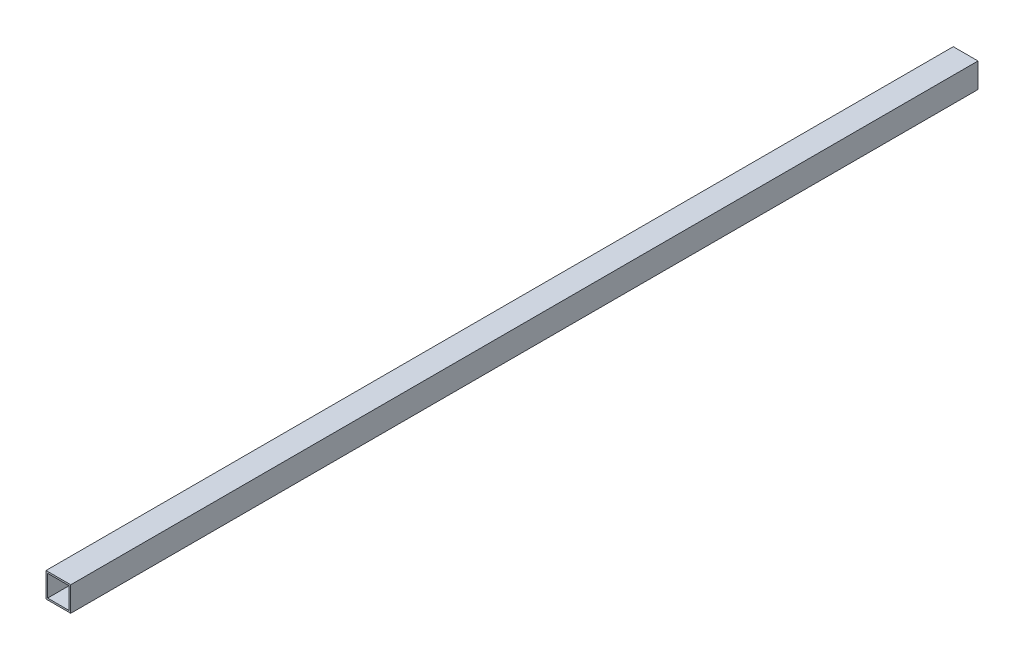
ISO-10303-21;
HEADER;
FILE_DESCRIPTION(('STEP AP214'),'2;1');
FILE_NAME('part.step','',(''),(''),'','','');
FILE_SCHEMA(('AUTOMOTIVE_DESIGN { 1 0 10303 214 1 1 1 1 }'));
ENDSEC;
DATA;
#1=APPLICATION_CONTEXT('core data for automotive mechanical design processes');
#2=APPLICATION_PROTOCOL_DEFINITION('international standard','automotive_design',2000,#1);
#3=PRODUCT_CONTEXT('',#1,'mechanical');
#4=PRODUCT('Part','Part','',(#3));
#5=PRODUCT_RELATED_PRODUCT_CATEGORY('part','',(#4));
#6=PRODUCT_DEFINITION_FORMATION('','',#4);
#7=PRODUCT_DEFINITION_CONTEXT('part definition',#1,'design');
#8=PRODUCT_DEFINITION('design','',#6,#7);
#9=PRODUCT_DEFINITION_SHAPE('','',#8);
#10=(LENGTH_UNIT() NAMED_UNIT(*) SI_UNIT(.MILLI.,.METRE.));
#11=(NAMED_UNIT(*) PLANE_ANGLE_UNIT() SI_UNIT($,.RADIAN.));
#12=(NAMED_UNIT(*) SI_UNIT($,.STERADIAN.) SOLID_ANGLE_UNIT());
#13=UNCERTAINTY_MEASURE_WITH_UNIT(LENGTH_MEASURE(1.E-05),#10,'distance_accuracy_value','');
#14=(GEOMETRIC_REPRESENTATION_CONTEXT(3) GLOBAL_UNCERTAINTY_ASSIGNED_CONTEXT((#13)) GLOBAL_UNIT_ASSIGNED_CONTEXT((#10,
#11,#12)) REPRESENTATION_CONTEXT('',''));
#15=CARTESIAN_POINT('',(0.,0.,0.));
#16=DIRECTION('',(0.,0.,1.));
#17=DIRECTION('',(1.,0.,0.));
#18=AXIS2_PLACEMENT_3D('',#15,#16,#17);
#19=CARTESIAN_POINT('',(-15.,-15.,1100.));
#20=DIRECTION('',(0.,0.,1.));
#21=DIRECTION('',(1.,0.,0.));
#22=AXIS2_PLACEMENT_3D('',#19,#20,#21);
#23=PLANE('',#22);
#24=DIRECTION('',(0.,-1.,0.));
#25=VECTOR('',#24,1.);
#26=CARTESIAN_POINT('',(-15.,15.,1100.));
#27=LINE('',#26,#25);
#28=CARTESIAN_POINT('',(-15.,15.,1100.));
#29=VERTEX_POINT('',#28);
#30=CARTESIAN_POINT('',(-15.,-15.,1100.));
#31=VERTEX_POINT('',#30);
#32=EDGE_CURVE('E155',#29,#31,#27,.T.);
#33=ORIENTED_EDGE('',*,*,#32,.T.);
#34=DIRECTION('',(1.,0.,0.));
#35=VECTOR('',#34,1.);
#36=CARTESIAN_POINT('',(-15.,-15.,1100.));
#37=LINE('',#36,#35);
#38=CARTESIAN_POINT('',(15.,-15.,1100.));
#39=VERTEX_POINT('',#38);
#40=EDGE_CURVE('E158',#31,#39,#37,.T.);
#41=ORIENTED_EDGE('',*,*,#40,.T.);
#42=DIRECTION('',(0.,1.,0.));
#43=VECTOR('',#42,1.);
#44=CARTESIAN_POINT('',(15.,15.,1100.));
#45=LINE('',#44,#43);
#46=CARTESIAN_POINT('',(15.,15.,1100.));
#47=VERTEX_POINT('',#46);
#48=EDGE_CURVE('E161',#39,#47,#45,.T.);
#49=ORIENTED_EDGE('',*,*,#48,.T.);
#50=DIRECTION('',(-1.,0.,0.));
#51=VECTOR('',#50,1.);
#52=CARTESIAN_POINT('',(-15.,15.,1100.));
#53=LINE('',#52,#51);
#54=EDGE_CURVE('E163',#47,#29,#53,.T.);
#55=ORIENTED_EDGE('',*,*,#54,.T.);
#56=EDGE_LOOP('',(#33,#41,#49,#55));
#57=FACE_BOUND('',#56,.T.);
#58=DIRECTION('',(1.,0.,0.));
#59=VECTOR('',#58,1.);
#60=CARTESIAN_POINT('',(-15.,-13.,1100.));
#61=LINE('',#60,#59);
#62=CARTESIAN_POINT('',(-13.,-13.,1100.));
#63=VERTEX_POINT('',#62);
#64=CARTESIAN_POINT('',(13.,-13.,1100.));
#65=VERTEX_POINT('',#64);
#66=EDGE_CURVE('E127',#63,#65,#61,.T.);
#67=ORIENTED_EDGE('',*,*,#66,.F.);
#68=DIRECTION('',(0.,-1.,0.));
#69=VECTOR('',#68,1.);
#70=CARTESIAN_POINT('',(-13.,15.,1100.));
#71=LINE('',#70,#69);
#72=CARTESIAN_POINT('',(-13.,13.,1100.));
#73=VERTEX_POINT('',#72);
#74=EDGE_CURVE('E119',#73,#63,#71,.T.);
#75=ORIENTED_EDGE('',*,*,#74,.F.);
#76=DIRECTION('',(-1.,0.,0.));
#77=VECTOR('',#76,1.);
#78=CARTESIAN_POINT('',(-15.,13.,1100.));
#79=LINE('',#78,#77);
#80=CARTESIAN_POINT('',(13.,13.,1100.));
#81=VERTEX_POINT('',#80);
#82=EDGE_CURVE('E141',#81,#73,#79,.T.);
#83=ORIENTED_EDGE('',*,*,#82,.F.);
#84=DIRECTION('',(0.,1.,0.));
#85=VECTOR('',#84,1.);
#86=CARTESIAN_POINT('',(13.,15.,1100.));
#87=LINE('',#86,#85);
#88=EDGE_CURVE('E139',#65,#81,#87,.T.);
#89=ORIENTED_EDGE('',*,*,#88,.F.);
#90=EDGE_LOOP('',(#67,#75,#83,#89));
#91=FACE_BOUND('',#90,.T.);
#92=ADVANCED_FACE('F54',(#57,#91),#23,.T.);
#93=CARTESIAN_POINT('',(-15.,-15.,0.));
#94=DIRECTION('',(0.,0.,1.));
#95=DIRECTION('',(1.,0.,0.));
#96=AXIS2_PLACEMENT_3D('',#93,#94,#95);
#97=PLANE('',#96);
#98=DIRECTION('',(0.,-1.,0.));
#99=VECTOR('',#98,1.);
#100=CARTESIAN_POINT('',(-15.,15.,0.));
#101=LINE('',#100,#99);
#102=CARTESIAN_POINT('',(-15.,15.,0.));
#103=VERTEX_POINT('',#102);
#104=CARTESIAN_POINT('',(-15.,-15.,0.));
#105=VERTEX_POINT('',#104);
#106=EDGE_CURVE('E135',#103,#105,#101,.T.);
#107=ORIENTED_EDGE('',*,*,#106,.F.);
#108=DIRECTION('',(-1.,0.,0.));
#109=VECTOR('',#108,1.);
#110=CARTESIAN_POINT('',(-15.,15.,0.));
#111=LINE('',#110,#109);
#112=CARTESIAN_POINT('',(15.,15.,0.));
#113=VERTEX_POINT('',#112);
#114=EDGE_CURVE('E159',#113,#103,#111,.T.);
#115=ORIENTED_EDGE('',*,*,#114,.F.);
#116=DIRECTION('',(0.,1.,0.));
#117=VECTOR('',#116,1.);
#118=CARTESIAN_POINT('',(15.,15.,0.));
#119=LINE('',#118,#117);
#120=CARTESIAN_POINT('',(15.,-15.,0.));
#121=VERTEX_POINT('',#120);
#122=EDGE_CURVE('E170',#121,#113,#119,.T.);
#123=ORIENTED_EDGE('',*,*,#122,.F.);
#124=DIRECTION('',(1.,0.,0.));
#125=VECTOR('',#124,1.);
#126=CARTESIAN_POINT('',(-15.,-15.,0.));
#127=LINE('',#126,#125);
#128=EDGE_CURVE('E168',#105,#121,#127,.T.);
#129=ORIENTED_EDGE('',*,*,#128,.F.);
#130=EDGE_LOOP('',(#107,#115,#123,#129));
#131=FACE_BOUND('',#130,.T.);
#132=DIRECTION('',(0.,-1.,0.));
#133=VECTOR('',#132,1.);
#134=CARTESIAN_POINT('',(-13.,15.,0.));
#135=LINE('',#134,#133);
#136=CARTESIAN_POINT('',(-13.,13.,0.));
#137=VERTEX_POINT('',#136);
#138=CARTESIAN_POINT('',(-13.,-13.,0.));
#139=VERTEX_POINT('',#138);
#140=EDGE_CURVE('E77',#137,#139,#135,.T.);
#141=ORIENTED_EDGE('',*,*,#140,.T.);
#142=DIRECTION('',(1.,0.,0.));
#143=VECTOR('',#142,1.);
#144=CARTESIAN_POINT('',(-15.,-13.,0.));
#145=LINE('',#144,#143);
#146=CARTESIAN_POINT('',(13.,-13.,0.));
#147=VERTEX_POINT('',#146);
#148=EDGE_CURVE('E134',#139,#147,#145,.T.);
#149=ORIENTED_EDGE('',*,*,#148,.T.);
#150=DIRECTION('',(0.,1.,0.));
#151=VECTOR('',#150,1.);
#152=CARTESIAN_POINT('',(13.,15.,0.));
#153=LINE('',#152,#151);
#154=CARTESIAN_POINT('',(13.,13.,0.));
#155=VERTEX_POINT('',#154);
#156=EDGE_CURVE('E147',#147,#155,#153,.T.);
#157=ORIENTED_EDGE('',*,*,#156,.T.);
#158=DIRECTION('',(-1.,0.,0.));
#159=VECTOR('',#158,1.);
#160=CARTESIAN_POINT('',(-15.,13.,0.));
#161=LINE('',#160,#159);
#162=EDGE_CURVE('E128',#155,#137,#161,.T.);
#163=ORIENTED_EDGE('',*,*,#162,.T.);
#164=EDGE_LOOP('',(#141,#149,#157,#163));
#165=FACE_BOUND('',#164,.T.);
#166=ADVANCED_FACE('F188',(#131,#165),#97,.F.);
#167=CARTESIAN_POINT('',(-15.,15.,1100.));
#168=DIRECTION('',(1.,0.,0.));
#169=DIRECTION('',(0.,1.,0.));
#170=AXIS2_PLACEMENT_3D('',#167,#168,#169);
#171=PLANE('',#170);
#172=ORIENTED_EDGE('',*,*,#106,.T.);
#173=DIRECTION('',(0.,0.,-1.));
#174=VECTOR('',#173,1.);
#175=CARTESIAN_POINT('',(-15.,-15.,1100.));
#176=LINE('',#175,#174);
#177=EDGE_CURVE('E12',#31,#105,#176,.T.);
#178=ORIENTED_EDGE('',*,*,#177,.F.);
#179=ORIENTED_EDGE('',*,*,#32,.F.);
#180=DIRECTION('',(0.,0.,-1.));
#181=VECTOR('',#180,1.);
#182=CARTESIAN_POINT('',(-15.,15.,1100.));
#183=LINE('',#182,#181);
#184=EDGE_CURVE('E165',#29,#103,#183,.T.);
#185=ORIENTED_EDGE('',*,*,#184,.T.);
#186=EDGE_LOOP('',(#172,#178,#179,#185));
#187=FACE_BOUND('',#186,.T.);
#188=ADVANCED_FACE('F56',(#187),#171,.F.);
#189=CARTESIAN_POINT('',(-15.,-15.,1100.));
#190=DIRECTION('',(0.,1.,0.));
#191=DIRECTION('',(-1.,0.,0.));
#192=AXIS2_PLACEMENT_3D('',#189,#190,#191);
#193=PLANE('',#192);
#194=ORIENTED_EDGE('',*,*,#128,.T.);
#195=DIRECTION('',(0.,0.,-1.));
#196=VECTOR('',#195,1.);
#197=CARTESIAN_POINT('',(15.,-15.,1100.));
#198=LINE('',#197,#196);
#199=EDGE_CURVE('E62',#39,#121,#198,.T.);
#200=ORIENTED_EDGE('',*,*,#199,.F.);
#201=ORIENTED_EDGE('',*,*,#40,.F.);
#202=ORIENTED_EDGE('',*,*,#177,.T.);
#203=EDGE_LOOP('',(#194,#200,#201,#202));
#204=FACE_BOUND('',#203,.T.);
#205=ADVANCED_FACE('F198',(#204),#193,.F.);
#206=CARTESIAN_POINT('',(15.,15.,1100.));
#207=DIRECTION('',(-1.,0.,0.));
#208=DIRECTION('',(0.,0.,1.));
#209=AXIS2_PLACEMENT_3D('',#206,#207,#208);
#210=PLANE('',#209);
#211=ORIENTED_EDGE('',*,*,#122,.T.);
#212=DIRECTION('',(0.,0.,-1.));
#213=VECTOR('',#212,1.);
#214=CARTESIAN_POINT('',(15.,15.,1100.));
#215=LINE('',#214,#213);
#216=EDGE_CURVE('E175',#47,#113,#215,.T.);
#217=ORIENTED_EDGE('',*,*,#216,.F.);
#218=ORIENTED_EDGE('',*,*,#48,.F.);
#219=ORIENTED_EDGE('',*,*,#199,.T.);
#220=EDGE_LOOP('',(#211,#217,#218,#219));
#221=FACE_BOUND('',#220,.T.);
#222=ADVANCED_FACE('F182',(#221),#210,.F.);
#223=CARTESIAN_POINT('',(-15.,15.,1100.));
#224=DIRECTION('',(0.,-1.,0.));
#225=DIRECTION('',(1.,0.,0.));
#226=AXIS2_PLACEMENT_3D('',#223,#224,#225);
#227=PLANE('',#226);
#228=ORIENTED_EDGE('',*,*,#114,.T.);
#229=ORIENTED_EDGE('',*,*,#184,.F.);
#230=ORIENTED_EDGE('',*,*,#54,.F.);
#231=ORIENTED_EDGE('',*,*,#216,.T.);
#232=EDGE_LOOP('',(#228,#229,#230,#231));
#233=FACE_BOUND('',#232,.T.);
#234=ADVANCED_FACE('F192',(#233),#227,.F.);
#235=CARTESIAN_POINT('',(-13.,15.,1100.));
#236=DIRECTION('',(1.,0.,0.));
#237=DIRECTION('',(0.,1.,0.));
#238=AXIS2_PLACEMENT_3D('',#235,#236,#237);
#239=PLANE('',#238);
#240=ORIENTED_EDGE('',*,*,#140,.F.);
#241=DIRECTION('',(0.,0.,-1.));
#242=VECTOR('',#241,1.);
#243=CARTESIAN_POINT('',(-13.,13.,1100.));
#244=LINE('',#243,#242);
#245=EDGE_CURVE('E123',#73,#137,#244,.T.);
#246=ORIENTED_EDGE('',*,*,#245,.F.);
#247=ORIENTED_EDGE('',*,*,#74,.T.);
#248=DIRECTION('',(0.,0.,-1.));
#249=VECTOR('',#248,1.);
#250=CARTESIAN_POINT('',(-13.,-13.,1100.));
#251=LINE('',#250,#249);
#252=EDGE_CURVE('E122',#63,#139,#251,.T.);
#253=ORIENTED_EDGE('',*,*,#252,.T.);
#254=EDGE_LOOP('',(#240,#246,#247,#253));
#255=FACE_BOUND('',#254,.T.);
#256=ADVANCED_FACE('F121',(#255),#239,.T.);
#257=CARTESIAN_POINT('',(-15.,-13.,1100.));
#258=DIRECTION('',(0.,1.,0.));
#259=DIRECTION('',(-1.,0.,0.));
#260=AXIS2_PLACEMENT_3D('',#257,#258,#259);
#261=PLANE('',#260);
#262=ORIENTED_EDGE('',*,*,#148,.F.);
#263=ORIENTED_EDGE('',*,*,#252,.F.);
#264=ORIENTED_EDGE('',*,*,#66,.T.);
#265=DIRECTION('',(0.,0.,-1.));
#266=VECTOR('',#265,1.);
#267=CARTESIAN_POINT('',(13.,-13.,1100.));
#268=LINE('',#267,#266);
#269=EDGE_CURVE('E136',#65,#147,#268,.T.);
#270=ORIENTED_EDGE('',*,*,#269,.T.);
#271=EDGE_LOOP('',(#262,#263,#264,#270));
#272=FACE_BOUND('',#271,.T.);
#273=ADVANCED_FACE('F131',(#272),#261,.T.);
#274=CARTESIAN_POINT('',(13.,15.,1100.));
#275=DIRECTION('',(-1.,0.,0.));
#276=DIRECTION('',(0.,0.,1.));
#277=AXIS2_PLACEMENT_3D('',#274,#275,#276);
#278=PLANE('',#277);
#279=ORIENTED_EDGE('',*,*,#156,.F.);
#280=ORIENTED_EDGE('',*,*,#269,.F.);
#281=ORIENTED_EDGE('',*,*,#88,.T.);
#282=DIRECTION('',(0.,0.,-1.));
#283=VECTOR('',#282,1.);
#284=CARTESIAN_POINT('',(13.,13.,1100.));
#285=LINE('',#284,#283);
#286=EDGE_CURVE('E69',#81,#155,#285,.T.);
#287=ORIENTED_EDGE('',*,*,#286,.T.);
#288=EDGE_LOOP('',(#279,#280,#281,#287));
#289=FACE_BOUND('',#288,.T.);
#290=ADVANCED_FACE('F221',(#289),#278,.T.);
#291=CARTESIAN_POINT('',(-15.,13.,1100.));
#292=DIRECTION('',(0.,-1.,0.));
#293=DIRECTION('',(1.,0.,0.));
#294=AXIS2_PLACEMENT_3D('',#291,#292,#293);
#295=PLANE('',#294);
#296=ORIENTED_EDGE('',*,*,#162,.F.);
#297=ORIENTED_EDGE('',*,*,#286,.F.);
#298=ORIENTED_EDGE('',*,*,#82,.T.);
#299=ORIENTED_EDGE('',*,*,#245,.T.);
#300=EDGE_LOOP('',(#296,#297,#298,#299));
#301=FACE_BOUND('',#300,.T.);
#302=ADVANCED_FACE('F225',(#301),#295,.T.);
#303=CLOSED_SHELL('',(#92,#166,#188,#205,#222,#234,#256,#273,#290,#302));
#304=MANIFOLD_SOLID_BREP('B2',#303);
#305=ADVANCED_BREP_SHAPE_REPRESENTATION('',(#18,#304),#14);
#306=SHAPE_DEFINITION_REPRESENTATION(#9,#305);
ENDSEC;
END-ISO-10303-21;
